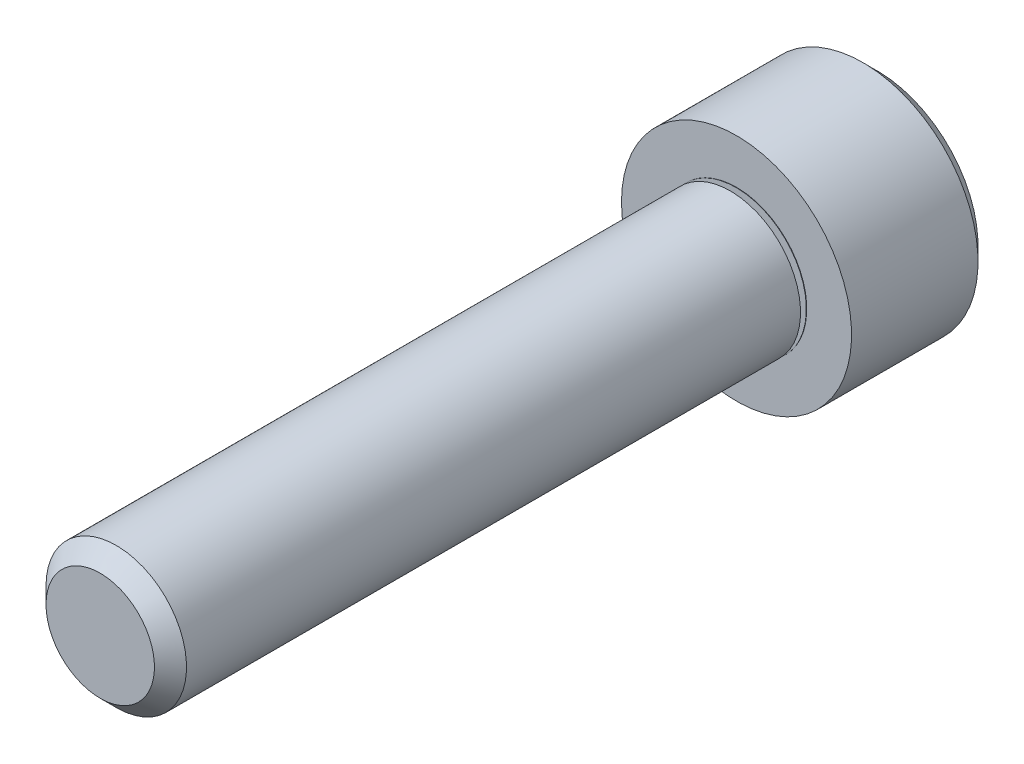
from build123d import *

# Parameters (mm, degrees)
CUT_EXTRUDE1_DEPTH = 1.7526


with BuildPart() as part:
    # Logo3_bib1 → Revolve1 (revolve)
    with BuildSketch(Plane(origin=(0, 0, 0), x_dir=(-1, 0, 0), z_dir=(0, -1, 0))):
        with BuildLine():
            Line((0, -15.875), (0, 3.5052))
            Line((0, 3.5052), (2.51968, 3.5052))
            Line((2.51968, 3.5052), (2.8702, 3.15468))
            Line((2.8702, 3.15468), (2.8702, 0))
            Line((2.8702, 0), (1.7526, 0))
            Line((1.7526, 0), (1.7526, -0.01))
            Line((1.7526, -0.01), (1.465975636, -0.01))
            ThreePointArc((1.465975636, -0.01), (1.446279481, -0.026527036), (1.459135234, -0.048793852))
            Line((1.459135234, -0.048793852), (1.7526, -0.155606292))
            Line((1.7526, -0.155606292), (1.7526, -15.47495))
            Line((1.7526, -15.47495), (1.35255, -15.875))
            Line((1.35255, -15.875), (0, -15.875))
        make_face()
    revolve(axis=Axis((0, 0, -10.585154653), (0, 0, 1)))

    # Logo3_bib2 → Cut-Extrude1 (cut)
    with BuildSketch(Plane(origin=(0, 0, -3.5052), x_dir=(1, 0, 0), z_dir=(0, 0, -1))):
        Polygon((1.603951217, 0), (0.801975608, 1.3890625), (-0.801975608, 1.3890625), (-1.603951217, 0), (-0.801975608, -1.3890625), (0.801975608, -1.3890625), align=None)
    extrude(amount=-CUT_EXTRUDE1_DEPTH, mode=Mode.SUBTRACT)


solid = part.part
